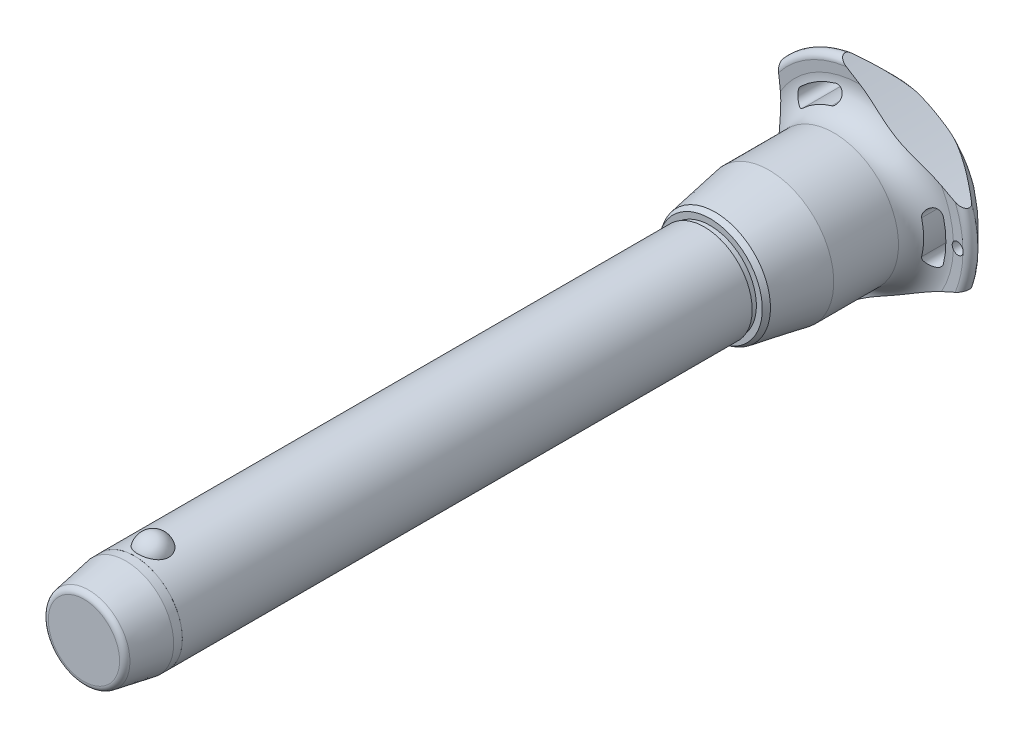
from build123d import *

# Parameters (mm, degrees)
SKETCH1_R           = 12.5
BOSS_EXTRUDE1_DEPTH = 140
SKETCH2_R           = 10
BOSS_EXTRUDE2_DEPTH = 50.7
BOSS_EXTRUDE3_START = 22
SKETCH1_2_R         = 12.5
BOSS_EXTRUDE3_DEPTH = 22
CHAMFER1_SIZE       = 11
CHAMFER1_SIZE2      = 1.939596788
FILLET1_R           = 1.5
SKETCH6_R           = 176.92625
CUT_EXTRUDE1_DEPTH  = 195.927884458
CIRPATTERN1_COUNT   = 3
SKETCH7_R           = 1.5
CUT_EXTRUDE2_DEPTH  = 195.849774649
SKETCH8_R           = 12.5
SKETCH8_R_2         = 12.49
CUT_EXTRUDE3_DEPTH  = 13.2


with BuildPart() as part:
    # Sketch1 → Boss-Extrude1 (new body)
    with BuildSketch(Plane.XY):
        Circle(SKETCH1_R)
    extrude(amount=-BOSS_EXTRUDE1_DEPTH)

    # Sketch2 → Boss-Extrude2 (add)
    with BuildSketch(Plane(origin=(0, 0, -140), x_dir=(-1, 0, 0), z_dir=(0, 0, -1))):
        with Locations(Location((0, 0, 0), (0, 0, 180))):
            Circle(SKETCH2_R)
    extrude(amount=BOSS_EXTRUDE2_DEPTH)

    # Sketch3 → Revolve1 (revolve)
    with BuildSketch(Plane(origin=(0, 0, 0), x_dir=(0, 0, -1), z_dir=(1, 0, 0))):
        with BuildLine():
            Line((-3.957271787, 15.4), (-3.957271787, 7.1))
            ThreePointArc((-3.957271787, 7.1), (0.192728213, 11.25), (-3.957271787, 15.4))
        make_face()
        with BuildLine():
            Line((-3.957271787, -7.1), (-3.957271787, -15.4))
            ThreePointArc((-3.957271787, -15.4), (0.192728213, -11.25), (-3.957271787, -7.1))
        make_face()
    revolve(axis=Axis((0, -7.1, 3.957271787), (0, 1, 0)))

    # Sketch1_2 → Boss-Extrude3 (add)
    with BuildSketch(Plane.XY.offset(BOSS_EXTRUDE3_START)):
        Circle(SKETCH1_2_R)
    extrude(amount=-BOSS_EXTRUDE3_DEPTH)

    # Chamfer1
    chamfer1_edges = [part.edges().sort_by_distance(p)[0] for p in [
        (-12.5, 0, 22),
    ]]
    chamfer1_side = [part.faces().sort_by_distance(p)[0] for p in [
        (-12.5, 0, -59),
    ]]
    chamfer(chamfer1_edges, length=CHAMFER1_SIZE, length2=CHAMFER1_SIZE2, reference=chamfer1_side[0])

    # Fillet1
    fillet1_edges = [part.edges().sort_by_distance(p)[0] for p in [
        (-10.560403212, 0, 22),
        (-10, 0, -190.7),
    ]]
    fillet(fillet1_edges, radius=FILLET1_R)

    # Sketch4 → Revolve2 (revolve)
    with BuildSketch(Plane(origin=(0, 0, 0), x_dir=(0, 0, -1), z_dir=(1, 0, 0)), mode=Mode.PRIVATE) as revolve2_sk:
        Polygon((140, 0), (140, 12.089202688), (141.5, 12.089202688), (141.5, 13.644437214), (142.846872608, 14.422054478), (156.9, 16.9), (173.8, 16.9), (173.8, 0), align=None)
    revolve(revolve2_sk.sketch.rotate(Axis((0, 0, -173.8), (0, 0, 1)), 90), axis=Axis((0, 0, -173.8), (0, 0, 1)))

    # Sketch5 → Revolve3 (revolve)
    with BuildSketch(Plane(origin=(0, 0, 0), x_dir=(0, 0, -1), z_dir=(1, 0, 0)), mode=Mode.PRIVATE) as revolve3_sk:
        with BuildLine():
            Line((180.790129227, 24.271609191), (180.652256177, 26.865060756))
            ThreePointArc((180.652256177, 26.865060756), (181.598671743, 28.411427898), (183.38137085, 28.08137085))
            Line((183.38137085, 28.08137085), (189.763226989, 21.69951471))
            ThreePointArc((189.763226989, 21.69951471), (190.7, 19.381044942), (189.683055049, 17.096604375))
            ThreePointArc((189.683055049, 17.096604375), (184.18864484, 9.321268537), (182.25, 0))
            Line((182.25, 0), (173.8, 0))
            Line((173.8, 0), (173.8, 16.9))
            ThreePointArc((173.8, 16.9), (178.879432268, 19.083427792), (180.790129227, 24.271609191))
        make_face()
    revolve(revolve3_sk.sketch.rotate(Axis((0, 0, -182.25), (0, 0, 1)), 90), axis=Axis((0, 0, -182.25), (0, 0, 1)))

    # Sketch6 → Cut-Extrude1 (cut, through all)
    with BuildSketch(Plane.XY):
        with Locations((-197.42625, 0)):
            Circle(SKETCH6_R)
        with BuildLine():
            ThreePointArc((21.802992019, -5.260839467), (22.428706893, 0), (21.802992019, 5.260839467))
            ThreePointArc((21.802992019, 5.260839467), (19.579234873, 6.620060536), (18.220013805, 4.39630339))
            ThreePointArc((18.220013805, 4.39630339), (18.742902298, 0), (18.220013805, -4.39630339))
            ThreePointArc((18.220013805, -4.39630339), (19.579234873, -6.620060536), (21.802992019, -5.260839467))
        make_face()
    cut_extrude1 = extrude(amount=-CUT_EXTRUDE1_DEPTH, mode=Mode.SUBTRACT)

    # CirPattern1: Cut-Extrude1 ×3 about axis
    cirpattern1_axis = Axis((0, 0, 0), (0, 0, 1))
    for i in range(1, CIRPATTERN1_COUNT):
        add(cut_extrude1.rotate(cirpattern1_axis, i * 360 / CIRPATTERN1_COUNT), mode=Mode.SUBTRACT)

    # Sketch7 → Cut-Extrude2 (cut, through all)
    with BuildSketch(Plane.XY):
        with Locations(Location((25.428706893, 0, 0), (0, 0, 17.230769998))):
            Circle(SKETCH7_R)
    extrude(amount=-CUT_EXTRUDE2_DEPTH, mode=Mode.SUBTRACT)

    # Sketch8 → Cut-Extrude3 (cut)
    with BuildSketch(Plane.XY.offset(22)):
        Circle(SKETCH8_R)
        Circle(SKETCH8_R_2, mode=Mode.SUBTRACT)
    extrude(amount=-CUT_EXTRUDE3_DEPTH, mode=Mode.SUBTRACT)


solid = part.part
